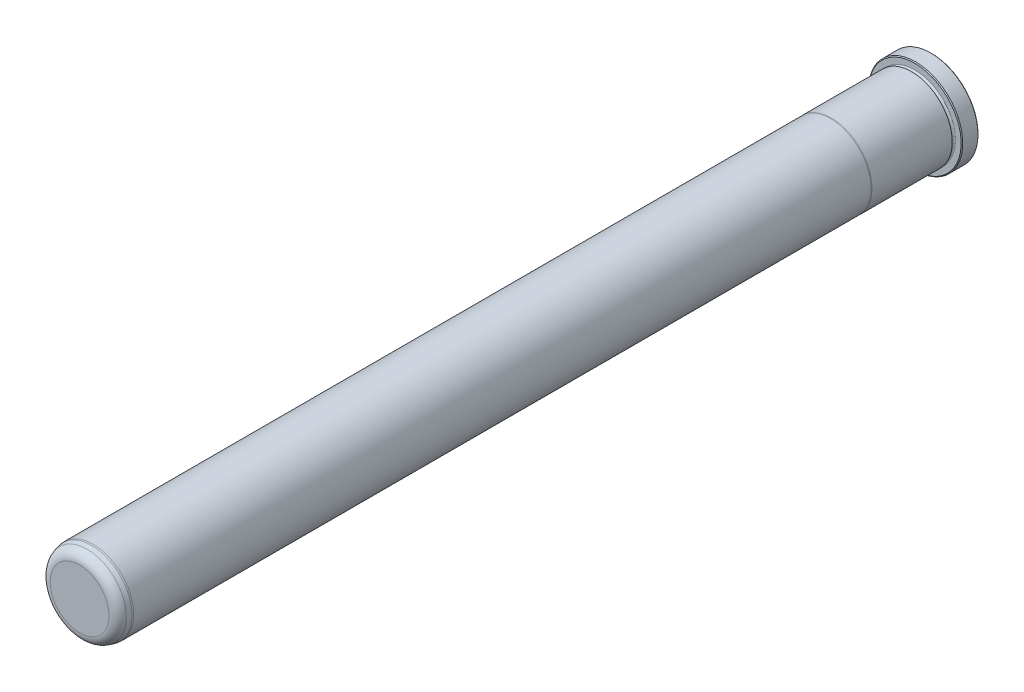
ISO-10303-21;
HEADER;
FILE_DESCRIPTION(('STEP AP214'),'2;1');
FILE_NAME('part.step','',(''),(''),'','','');
FILE_SCHEMA(('AUTOMOTIVE_DESIGN { 1 0 10303 214 1 1 1 1 }'));
ENDSEC;
DATA;
#1=APPLICATION_CONTEXT('core data for automotive mechanical design processes');
#2=APPLICATION_PROTOCOL_DEFINITION('international standard','automotive_design',2000,#1);
#3=PRODUCT_CONTEXT('',#1,'mechanical');
#4=PRODUCT('Part','Part','',(#3));
#5=PRODUCT_RELATED_PRODUCT_CATEGORY('part','',(#4));
#6=PRODUCT_DEFINITION_FORMATION('','',#4);
#7=PRODUCT_DEFINITION_CONTEXT('part definition',#1,'design');
#8=PRODUCT_DEFINITION('design','',#6,#7);
#9=PRODUCT_DEFINITION_SHAPE('','',#8);
#10=(LENGTH_UNIT() NAMED_UNIT(*) SI_UNIT(.MILLI.,.METRE.));
#11=(NAMED_UNIT(*) PLANE_ANGLE_UNIT() SI_UNIT($,.RADIAN.));
#12=(NAMED_UNIT(*) SI_UNIT($,.STERADIAN.) SOLID_ANGLE_UNIT());
#13=UNCERTAINTY_MEASURE_WITH_UNIT(LENGTH_MEASURE(1.E-05),#10,'distance_accuracy_value','');
#14=(GEOMETRIC_REPRESENTATION_CONTEXT(3) GLOBAL_UNCERTAINTY_ASSIGNED_CONTEXT((#13)) GLOBAL_UNIT_ASSIGNED_CONTEXT((#10,
#11,#12)) REPRESENTATION_CONTEXT('',''));
#15=CARTESIAN_POINT('',(0.,0.,0.));
#16=DIRECTION('',(0.,0.,1.));
#17=DIRECTION('',(1.,0.,0.));
#18=AXIS2_PLACEMENT_3D('',#15,#16,#17);
#19=CARTESIAN_POINT('',(0.,0.,0.));
#20=DIRECTION('',(0.,0.,1.));
#21=DIRECTION('',(1.,0.,0.));
#22=AXIS2_PLACEMENT_3D('',#19,#20,#21);
#23=PLANE('',#22);
#24=CARTESIAN_POINT('',(0.,0.,0.));
#25=DIRECTION('',(0.,0.,1.));
#26=DIRECTION('',(1.,0.,0.));
#27=AXIS2_PLACEMENT_3D('',#24,#25,#26);
#28=CIRCLE('',#27,21.7169999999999);
#29=CARTESIAN_POINT('',(21.7169999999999,0.,0.));
#30=VERTEX_POINT('',#29);
#31=EDGE_CURVE('E37',#30,#30,#28,.F.);
#32=ORIENTED_EDGE('',*,*,#31,.T.);
#33=EDGE_LOOP('',(#32));
#34=FACE_BOUND('',#33,.T.);
#35=ADVANCED_FACE('F30',(#34),#23,.F.);
#36=CARTESIAN_POINT('',(0.,0.,0.));
#37=DIRECTION('',(0.,0.,1.));
#38=DIRECTION('',(1.,0.,0.));
#39=AXIS2_PLACEMENT_3D('',#36,#37,#38);
#40=CYLINDRICAL_SURFACE('',#39,22.098);
#41=CARTESIAN_POINT('',(0.,0.,0.381000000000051));
#42=DIRECTION('',(0.,0.,1.));
#43=DIRECTION('',(1.,0.,0.));
#44=AXIS2_PLACEMENT_3D('',#41,#42,#43);
#45=CIRCLE('',#44,22.098);
#46=CARTESIAN_POINT('',(22.098,0.,0.381000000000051));
#47=VERTEX_POINT('',#46);
#48=EDGE_CURVE('E41',#47,#47,#45,.T.);
#49=ORIENTED_EDGE('',*,*,#48,.T.);
#50=EDGE_LOOP('',(#49));
#51=FACE_BOUND('',#50,.T.);
#52=CARTESIAN_POINT('',(0.,0.,7.54379999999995));
#53=DIRECTION('',(0.,0.,-1.));
#54=DIRECTION('',(-1.,0.,0.));
#55=AXIS2_PLACEMENT_3D('',#52,#53,#54);
#56=CIRCLE('',#55,22.098);
#57=CARTESIAN_POINT('',(-22.098,0.,7.54379999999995));
#58=VERTEX_POINT('',#57);
#59=EDGE_CURVE('E45',#58,#58,#56,.T.);
#60=ORIENTED_EDGE('',*,*,#59,.T.);
#61=EDGE_LOOP('',(#60));
#62=FACE_BOUND('',#61,.T.);
#63=ADVANCED_FACE('F118',(#51,#62),#40,.T.);
#64=CARTESIAN_POINT('',(0.,22.098,7.9248));
#65=DIRECTION('',(0.,0.,-1.));
#66=DIRECTION('',(-1.,0.,0.));
#67=AXIS2_PLACEMENT_3D('',#64,#65,#66);
#68=PLANE('',#67);
#69=CARTESIAN_POINT('',(0.,0.,7.9248));
#70=DIRECTION('',(0.,0.,-1.));
#71=DIRECTION('',(-1.,0.,0.));
#72=AXIS2_PLACEMENT_3D('',#69,#70,#71);
#73=CIRCLE('',#72,21.7169999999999);
#74=CARTESIAN_POINT('',(-21.7169999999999,0.,7.9248));
#75=VERTEX_POINT('',#74);
#76=EDGE_CURVE('E10',#75,#75,#73,.F.);
#77=ORIENTED_EDGE('',*,*,#76,.T.);
#78=EDGE_LOOP('',(#77));
#79=FACE_BOUND('',#78,.T.);
#80=CARTESIAN_POINT('',(0.,0.,7.9248));
#81=DIRECTION('',(0.,0.,1.));
#82=DIRECTION('',(1.,0.,0.));
#83=AXIS2_PLACEMENT_3D('',#80,#81,#82);
#84=CIRCLE('',#83,19.0373);
#85=CARTESIAN_POINT('',(19.0373,0.,7.9248));
#86=VERTEX_POINT('',#85);
#87=EDGE_CURVE('E56',#86,#86,#84,.T.);
#88=ORIENTED_EDGE('',*,*,#87,.F.);
#89=EDGE_LOOP('',(#88));
#90=FACE_BOUND('',#89,.T.);
#91=ADVANCED_FACE('F113',(#79,#90),#68,.F.);
#92=CARTESIAN_POINT('',(0.,0.,8.6868));
#93=DIRECTION('',(0.,0.,1.));
#94=DIRECTION('',(1.,0.,0.));
#95=AXIS2_PLACEMENT_3D('',#92,#93,#94);
#96=TOROIDAL_SURFACE('',#95,19.0373,0.762);
#97=CARTESIAN_POINT('',(0.,0.,9.4488));
#98=DIRECTION('',(0.,0.,1.));
#99=DIRECTION('',(1.,0.,0.));
#100=AXIS2_PLACEMENT_3D('',#97,#98,#99);
#101=CIRCLE('',#100,19.0373);
#102=CARTESIAN_POINT('',(19.0373,0.,9.4488));
#103=VERTEX_POINT('',#102);
#104=EDGE_CURVE('E59',#103,#103,#101,.T.);
#105=ORIENTED_EDGE('',*,*,#104,.F.);
#106=EDGE_LOOP('',(#105));
#107=FACE_BOUND('',#106,.T.);
#108=ORIENTED_EDGE('',*,*,#87,.T.);
#109=EDGE_LOOP('',(#108));
#110=FACE_BOUND('',#109,.T.);
#111=ADVANCED_FACE('F107',(#107,#110),#96,.F.);
#112=CARTESIAN_POINT('',(0.,19.0373,9.4488));
#113=DIRECTION('',(0.,0.,1.));
#114=DIRECTION('',(1.,0.,0.));
#115=AXIS2_PLACEMENT_3D('',#112,#113,#114);
#116=PLANE('',#115);
#117=CARTESIAN_POINT('',(0.,0.,9.4488));
#118=DIRECTION('',(0.,0.,1.));
#119=DIRECTION('',(1.,0.,0.));
#120=AXIS2_PLACEMENT_3D('',#117,#118,#119);
#121=CIRCLE('',#120,19.0627);
#122=CARTESIAN_POINT('',(19.0627,0.,9.4488));
#123=VERTEX_POINT('',#122);
#124=EDGE_CURVE('E62',#123,#123,#121,.T.);
#125=ORIENTED_EDGE('',*,*,#124,.F.);
#126=EDGE_LOOP('',(#125));
#127=FACE_BOUND('',#126,.T.);
#128=ORIENTED_EDGE('',*,*,#104,.T.);
#129=EDGE_LOOP('',(#128));
#130=FACE_BOUND('',#129,.T.);
#131=ADVANCED_FACE('F101',(#127,#130),#116,.F.);
#132=CARTESIAN_POINT('',(0.,0.,0.));
#133=DIRECTION('',(0.,0.,1.));
#134=DIRECTION('',(1.,0.,0.));
#135=AXIS2_PLACEMENT_3D('',#132,#133,#134);
#136=CYLINDRICAL_SURFACE('',#135,19.0627);
#137=CARTESIAN_POINT('',(0.,0.,47.1347630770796));
#138=DIRECTION('',(0.,0.,1.));
#139=DIRECTION('',(1.,0.,0.));
#140=AXIS2_PLACEMENT_3D('',#137,#138,#139);
#141=CIRCLE('',#140,19.0627);
#142=CARTESIAN_POINT('',(19.0627,0.,47.1347630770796));
#143=VERTEX_POINT('',#142);
#144=EDGE_CURVE('E65',#143,#143,#141,.T.);
#145=ORIENTED_EDGE('',*,*,#144,.F.);
#146=EDGE_LOOP('',(#145));
#147=FACE_BOUND('',#146,.T.);
#148=ORIENTED_EDGE('',*,*,#124,.T.);
#149=EDGE_LOOP('',(#148));
#150=FACE_BOUND('',#149,.T.);
#151=ADVANCED_FACE('F95',(#147,#150),#136,.T.);
#152=CARTESIAN_POINT('',(0.,0.,47.1347630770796));
#153=DIRECTION('',(0.,0.,-1.));
#154=DIRECTION('',(-1.,0.,0.));
#155=AXIS2_PLACEMENT_3D('',#152,#153,#154);
#156=CONICAL_SURFACE('',#155,19.0627,0.0698131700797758);
#157=CARTESIAN_POINT('',(0.,0.,47.498));
#158=DIRECTION('',(0.,0.,1.));
#159=DIRECTION('',(1.,0.,0.));
#160=AXIS2_PLACEMENT_3D('',#157,#158,#159);
#161=CIRCLE('',#160,19.0373);
#162=CARTESIAN_POINT('',(19.0373,0.,47.498));
#163=VERTEX_POINT('',#162);
#164=EDGE_CURVE('E68',#163,#163,#161,.T.);
#165=ORIENTED_EDGE('',*,*,#164,.F.);
#166=EDGE_LOOP('',(#165));
#167=FACE_BOUND('',#166,.T.);
#168=ORIENTED_EDGE('',*,*,#144,.T.);
#169=EDGE_LOOP('',(#168));
#170=FACE_BOUND('',#169,.T.);
#171=ADVANCED_FACE('F89',(#167,#170),#156,.T.);
#172=CARTESIAN_POINT('',(0.,0.,0.));
#173=DIRECTION('',(0.,0.,1.));
#174=DIRECTION('',(1.,0.,0.));
#175=AXIS2_PLACEMENT_3D('',#172,#173,#174);
#176=CYLINDRICAL_SURFACE('',#175,19.0373);
#177=CARTESIAN_POINT('',(0.,0.,393.7));
#178=DIRECTION('',(0.,0.,1.));
#179=DIRECTION('',(1.,0.,0.));
#180=AXIS2_PLACEMENT_3D('',#177,#178,#179);
#181=CIRCLE('',#180,19.0373);
#182=CARTESIAN_POINT('',(19.0373,0.,393.7));
#183=VERTEX_POINT('',#182);
#184=EDGE_CURVE('E71',#183,#183,#181,.T.);
#185=ORIENTED_EDGE('',*,*,#184,.F.);
#186=EDGE_LOOP('',(#185));
#187=FACE_BOUND('',#186,.T.);
#188=ORIENTED_EDGE('',*,*,#164,.T.);
#189=EDGE_LOOP('',(#188));
#190=FACE_BOUND('',#189,.T.);
#191=ADVANCED_FACE('F83',(#187,#190),#176,.T.);
#192=CARTESIAN_POINT('',(0.,0.,393.7));
#193=DIRECTION('',(0.,0.,-1.));
#194=DIRECTION('',(-1.,0.,0.));
#195=AXIS2_PLACEMENT_3D('',#192,#193,#194);
#196=CONICAL_SURFACE('',#195,19.0373,0.0872664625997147);
#197=CARTESIAN_POINT('',(0.,0.,394.462));
#198=DIRECTION('',(0.,0.,1.));
#199=DIRECTION('',(1.,0.,0.));
#200=AXIS2_PLACEMENT_3D('',#197,#198,#199);
#201=CIRCLE('',#200,18.9706336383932);
#202=CARTESIAN_POINT('',(18.9706336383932,0.,394.462));
#203=VERTEX_POINT('',#202);
#204=EDGE_CURVE('E74',#203,#203,#201,.T.);
#205=ORIENTED_EDGE('',*,*,#204,.F.);
#206=EDGE_LOOP('',(#205));
#207=FACE_BOUND('',#206,.T.);
#208=ORIENTED_EDGE('',*,*,#184,.T.);
#209=EDGE_LOOP('',(#208));
#210=FACE_BOUND('',#209,.T.);
#211=ADVANCED_FACE('F80',(#207,#210),#196,.T.);
#212=CARTESIAN_POINT('',(0.,0.,394.462));
#213=DIRECTION('',(0.,0.,-1.));
#214=DIRECTION('',(-1.,0.,0.));
#215=AXIS2_PLACEMENT_3D('',#212,#213,#214);
#216=CONICAL_SURFACE('',#215,18.9706336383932,0.26179938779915);
#217=CARTESIAN_POINT('',(0.,0.,396.520125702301));
#218=DIRECTION('',(0.,0.,1.));
#219=DIRECTION('',(1.,0.,0.));
#220=AXIS2_PLACEMENT_3D('',#217,#218,#219);
#221=CIRCLE('',#220,18.41916051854);
#222=CARTESIAN_POINT('',(18.41916051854,0.,396.520125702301));
#223=VERTEX_POINT('',#222);
#224=EDGE_CURVE('E50',#223,#223,#221,.F.);
#225=ORIENTED_EDGE('',*,*,#224,.T.);
#226=EDGE_LOOP('',(#225));
#227=FACE_BOUND('',#226,.T.);
#228=ORIENTED_EDGE('',*,*,#204,.T.);
#229=EDGE_LOOP('',(#228));
#230=FACE_BOUND('',#229,.T.);
#231=ADVANCED_FACE('F78',(#227,#230),#216,.T.);
#232=CARTESIAN_POINT('',(0.,17.4733335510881,400.05));
#233=DIRECTION('',(0.,0.,-1.));
#234=DIRECTION('',(-1.,0.,0.));
#235=AXIS2_PLACEMENT_3D('',#232,#233,#234);
#236=PLANE('',#235);
#237=CARTESIAN_POINT('',(0.,0.,400.05));
#238=DIRECTION('',(0.,0.,-1.));
#239=DIRECTION('',(-1.,0.,0.));
#240=AXIS2_PLACEMENT_3D('',#237,#238,#239);
#241=CIRCLE('',#240,13.8189387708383);
#242=CARTESIAN_POINT('',(-13.8189387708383,0.,400.05));
#243=VERTEX_POINT('',#242);
#244=EDGE_CURVE('E53',#243,#243,#241,.F.);
#245=ORIENTED_EDGE('',*,*,#244,.T.);
#246=EDGE_LOOP('',(#245));
#247=FACE_BOUND('',#246,.T.);
#248=ADVANCED_FACE('F133',(#247),#236,.F.);
#249=CARTESIAN_POINT('',(0.,0.,395.2875));
#250=DIRECTION('',(0.,0.,-1.));
#251=DIRECTION('',(-1.,0.,0.));
#252=AXIS2_PLACEMENT_3D('',#249,#250,#251);
#253=TOROIDAL_SURFACE('',#252,13.8189387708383,4.7625);
#254=ORIENTED_EDGE('',*,*,#224,.F.);
#255=EDGE_LOOP('',(#254));
#256=FACE_BOUND('',#255,.T.);
#257=ORIENTED_EDGE('',*,*,#244,.F.);
#258=EDGE_LOOP('',(#257));
#259=FACE_BOUND('',#258,.T.);
#260=ADVANCED_FACE('F130',(#256,#259),#253,.T.);
#261=CARTESIAN_POINT('',(0.,0.,0.381000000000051));
#262=DIRECTION('',(0.,0.,1.));
#263=DIRECTION('',(1.,0.,0.));
#264=AXIS2_PLACEMENT_3D('',#261,#262,#263);
#265=CONICAL_SURFACE('',#264,22.098,0.785398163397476);
#266=ORIENTED_EDGE('',*,*,#31,.F.);
#267=EDGE_LOOP('',(#266));
#268=FACE_BOUND('',#267,.T.);
#269=ORIENTED_EDGE('',*,*,#48,.F.);
#270=EDGE_LOOP('',(#269));
#271=FACE_BOUND('',#270,.T.);
#272=ADVANCED_FACE('F132',(#268,#271),#265,.T.);
#273=CARTESIAN_POINT('',(0.,0.,7.9248));
#274=DIRECTION('',(0.,0.,-1.));
#275=DIRECTION('',(-1.,0.,0.));
#276=AXIS2_PLACEMENT_3D('',#273,#274,#275);
#277=CONICAL_SURFACE('',#276,21.7169999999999,0.785398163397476);
#278=ORIENTED_EDGE('',*,*,#59,.F.);
#279=EDGE_LOOP('',(#278));
#280=FACE_BOUND('',#279,.T.);
#281=ORIENTED_EDGE('',*,*,#76,.F.);
#282=EDGE_LOOP('',(#281));
#283=FACE_BOUND('',#282,.T.);
#284=ADVANCED_FACE('F32',(#280,#283),#277,.T.);
#285=CLOSED_SHELL('',(#35,#63,#91,#111,#131,#151,#171,#191,#211,#231,#248,#260,#272,#284));
#286=MANIFOLD_SOLID_BREP('B2',#285);
#287=ADVANCED_BREP_SHAPE_REPRESENTATION('',(#18,#286),#14);
#288=SHAPE_DEFINITION_REPRESENTATION(#9,#287);
ENDSEC;
END-ISO-10303-21;
